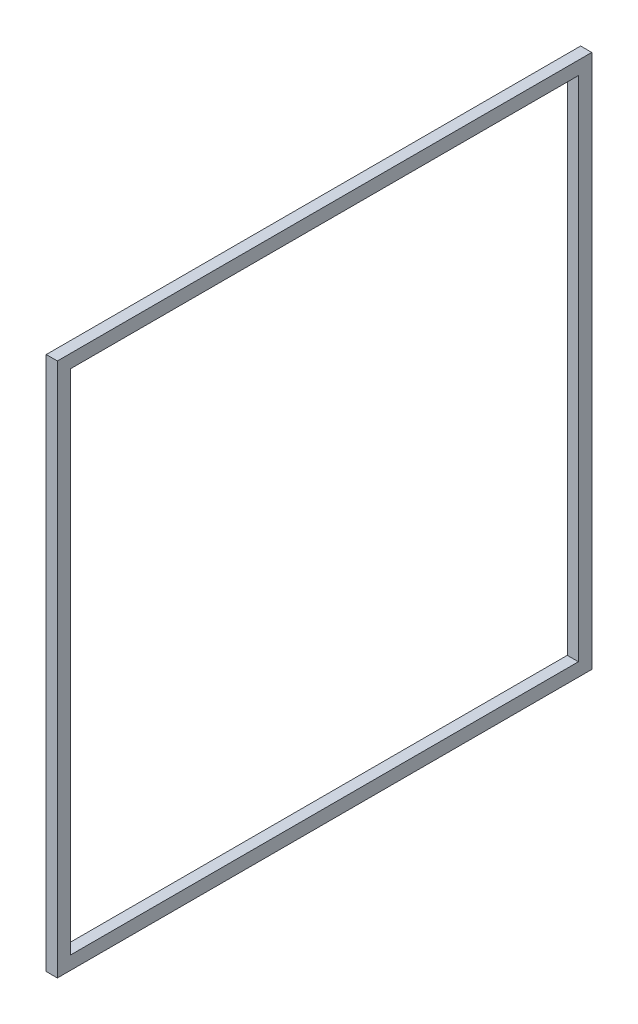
ISO-10303-21;
HEADER;
FILE_DESCRIPTION(('STEP AP214'),'2;1');
FILE_NAME('part.step','',(''),(''),'','','');
FILE_SCHEMA(('AUTOMOTIVE_DESIGN { 1 0 10303 214 1 1 1 1 }'));
ENDSEC;
DATA;
#1=APPLICATION_CONTEXT('core data for automotive mechanical design processes');
#2=APPLICATION_PROTOCOL_DEFINITION('international standard','automotive_design',2000,#1);
#3=PRODUCT_CONTEXT('',#1,'mechanical');
#4=PRODUCT('Part','Part','',(#3));
#5=PRODUCT_RELATED_PRODUCT_CATEGORY('part','',(#4));
#6=PRODUCT_DEFINITION_FORMATION('','',#4);
#7=PRODUCT_DEFINITION_CONTEXT('part definition',#1,'design');
#8=PRODUCT_DEFINITION('design','',#6,#7);
#9=PRODUCT_DEFINITION_SHAPE('','',#8);
#10=(LENGTH_UNIT() NAMED_UNIT(*) SI_UNIT(.MILLI.,.METRE.));
#11=(NAMED_UNIT(*) PLANE_ANGLE_UNIT() SI_UNIT($,.RADIAN.));
#12=(NAMED_UNIT(*) SI_UNIT($,.STERADIAN.) SOLID_ANGLE_UNIT());
#13=UNCERTAINTY_MEASURE_WITH_UNIT(LENGTH_MEASURE(1.E-05),#10,'distance_accuracy_value','');
#14=(GEOMETRIC_REPRESENTATION_CONTEXT(3) GLOBAL_UNCERTAINTY_ASSIGNED_CONTEXT((#13)) GLOBAL_UNIT_ASSIGNED_CONTEXT((#10,
#11,#12)) REPRESENTATION_CONTEXT('',''));
#15=CARTESIAN_POINT('',(0.,0.,0.));
#16=DIRECTION('',(0.,0.,1.));
#17=DIRECTION('',(1.,0.,0.));
#18=AXIS2_PLACEMENT_3D('',#15,#16,#17);
#19=CARTESIAN_POINT('',(6.34999999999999,0.,0.));
#20=DIRECTION('',(1.,0.,0.));
#21=DIRECTION('',(0.,0.,-1.));
#22=AXIS2_PLACEMENT_3D('',#19,#20,#21);
#23=PLANE('',#22);
#24=DIRECTION('',(0.,0.,-1.));
#25=VECTOR('',#24,1.);
#26=CARTESIAN_POINT('',(6.34999999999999,-152.4,152.4));
#27=LINE('',#26,#25);
#28=CARTESIAN_POINT('',(6.34999999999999,-152.4,152.4));
#29=VERTEX_POINT('',#28);
#30=CARTESIAN_POINT('',(6.34999999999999,-152.4,-152.4));
#31=VERTEX_POINT('',#30);
#32=EDGE_CURVE('E156',#29,#31,#27,.T.);
#33=ORIENTED_EDGE('',*,*,#32,.T.);
#34=DIRECTION('',(0.,1.,0.));
#35=VECTOR('',#34,1.);
#36=CARTESIAN_POINT('',(6.34999999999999,-152.4,-152.4));
#37=LINE('',#36,#35);
#38=CARTESIAN_POINT('',(6.34999999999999,152.4,-152.4));
#39=VERTEX_POINT('',#38);
#40=EDGE_CURVE('E164',#31,#39,#37,.T.);
#41=ORIENTED_EDGE('',*,*,#40,.T.);
#42=DIRECTION('',(0.,0.,1.));
#43=VECTOR('',#42,1.);
#44=CARTESIAN_POINT('',(6.34999999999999,152.4,-152.4));
#45=LINE('',#44,#43);
#46=CARTESIAN_POINT('',(6.34999999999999,152.4,152.4));
#47=VERTEX_POINT('',#46);
#48=EDGE_CURVE('E168',#39,#47,#45,.T.);
#49=ORIENTED_EDGE('',*,*,#48,.T.);
#50=DIRECTION('',(0.,-1.,0.));
#51=VECTOR('',#50,1.);
#52=CARTESIAN_POINT('',(6.34999999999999,152.4,152.4));
#53=LINE('',#52,#51);
#54=EDGE_CURVE('E170',#47,#29,#53,.T.);
#55=ORIENTED_EDGE('',*,*,#54,.T.);
#56=EDGE_LOOP('',(#33,#41,#49,#55));
#57=FACE_BOUND('',#56,.T.);
#58=DIRECTION('',(0.,1.,0.));
#59=VECTOR('',#58,1.);
#60=CARTESIAN_POINT('',(6.34999999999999,-144.78,-144.78));
#61=LINE('',#60,#59);
#62=CARTESIAN_POINT('',(6.34999999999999,-144.78,-144.78));
#63=VERTEX_POINT('',#62);
#64=CARTESIAN_POINT('',(6.34999999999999,144.78,-144.78));
#65=VERTEX_POINT('',#64);
#66=EDGE_CURVE('E120',#63,#65,#61,.T.);
#67=ORIENTED_EDGE('',*,*,#66,.F.);
#68=DIRECTION('',(0.,0.,-1.));
#69=VECTOR('',#68,1.);
#70=CARTESIAN_POINT('',(6.34999999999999,-144.78,144.78));
#71=LINE('',#70,#69);
#72=CARTESIAN_POINT('',(6.34999999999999,-144.78,144.78));
#73=VERTEX_POINT('',#72);
#74=EDGE_CURVE('E107',#73,#63,#71,.T.);
#75=ORIENTED_EDGE('',*,*,#74,.F.);
#76=DIRECTION('',(0.,-1.,0.));
#77=VECTOR('',#76,1.);
#78=CARTESIAN_POINT('',(6.34999999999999,144.78,144.78));
#79=LINE('',#78,#77);
#80=CARTESIAN_POINT('',(6.34999999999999,144.78,144.78));
#81=VERTEX_POINT('',#80);
#82=EDGE_CURVE('E136',#81,#73,#79,.T.);
#83=ORIENTED_EDGE('',*,*,#82,.F.);
#84=DIRECTION('',(0.,0.,1.));
#85=VECTOR('',#84,1.);
#86=CARTESIAN_POINT('',(6.34999999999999,144.78,-144.78));
#87=LINE('',#86,#85);
#88=EDGE_CURVE('E131',#65,#81,#87,.T.);
#89=ORIENTED_EDGE('',*,*,#88,.F.);
#90=EDGE_LOOP('',(#67,#75,#83,#89));
#91=FACE_BOUND('',#90,.T.);
#92=ADVANCED_FACE('F43',(#57,#91),#23,.T.);
#93=CARTESIAN_POINT('',(0.,0.,0.));
#94=DIRECTION('',(1.,0.,0.));
#95=DIRECTION('',(0.,0.,-1.));
#96=AXIS2_PLACEMENT_3D('',#93,#94,#95);
#97=PLANE('',#96);
#98=DIRECTION('',(0.,0.,-1.));
#99=VECTOR('',#98,1.);
#100=CARTESIAN_POINT('',(0.,-152.4,152.4));
#101=LINE('',#100,#99);
#102=CARTESIAN_POINT('',(0.,-152.4,152.4));
#103=VERTEX_POINT('',#102);
#104=CARTESIAN_POINT('',(0.,-152.4,-152.4));
#105=VERTEX_POINT('',#104);
#106=EDGE_CURVE('E130',#103,#105,#101,.T.);
#107=ORIENTED_EDGE('',*,*,#106,.F.);
#108=DIRECTION('',(0.,-1.,0.));
#109=VECTOR('',#108,1.);
#110=CARTESIAN_POINT('',(0.,152.4,152.4));
#111=LINE('',#110,#109);
#112=CARTESIAN_POINT('',(0.,152.4,152.4));
#113=VERTEX_POINT('',#112);
#114=EDGE_CURVE('E165',#113,#103,#111,.T.);
#115=ORIENTED_EDGE('',*,*,#114,.F.);
#116=DIRECTION('',(0.,0.,1.));
#117=VECTOR('',#116,1.);
#118=CARTESIAN_POINT('',(0.,152.4,-152.4));
#119=LINE('',#118,#117);
#120=CARTESIAN_POINT('',(0.,152.4,-152.4));
#121=VERTEX_POINT('',#120);
#122=EDGE_CURVE('E177',#121,#113,#119,.T.);
#123=ORIENTED_EDGE('',*,*,#122,.F.);
#124=DIRECTION('',(0.,1.,0.));
#125=VECTOR('',#124,1.);
#126=CARTESIAN_POINT('',(0.,-152.4,-152.4));
#127=LINE('',#126,#125);
#128=EDGE_CURVE('E176',#105,#121,#127,.T.);
#129=ORIENTED_EDGE('',*,*,#128,.F.);
#130=EDGE_LOOP('',(#107,#115,#123,#129));
#131=FACE_BOUND('',#130,.T.);
#132=DIRECTION('',(0.,0.,-1.));
#133=VECTOR('',#132,1.);
#134=CARTESIAN_POINT('',(0.,-144.78,144.78));
#135=LINE('',#134,#133);
#136=CARTESIAN_POINT('',(0.,-144.78,144.78));
#137=VERTEX_POINT('',#136);
#138=CARTESIAN_POINT('',(0.,-144.78,-144.78));
#139=VERTEX_POINT('',#138);
#140=EDGE_CURVE('E70',#137,#139,#135,.T.);
#141=ORIENTED_EDGE('',*,*,#140,.T.);
#142=DIRECTION('',(0.,1.,0.));
#143=VECTOR('',#142,1.);
#144=CARTESIAN_POINT('',(0.,-144.78,-144.78));
#145=LINE('',#144,#143);
#146=CARTESIAN_POINT('',(0.,144.78,-144.78));
#147=VERTEX_POINT('',#146);
#148=EDGE_CURVE('E124',#139,#147,#145,.T.);
#149=ORIENTED_EDGE('',*,*,#148,.T.);
#150=DIRECTION('',(0.,0.,1.));
#151=VECTOR('',#150,1.);
#152=CARTESIAN_POINT('',(0.,144.78,-144.78));
#153=LINE('',#152,#151);
#154=CARTESIAN_POINT('',(0.,144.78,144.78));
#155=VERTEX_POINT('',#154);
#156=EDGE_CURVE('E144',#147,#155,#153,.T.);
#157=ORIENTED_EDGE('',*,*,#156,.T.);
#158=DIRECTION('',(0.,-1.,0.));
#159=VECTOR('',#158,1.);
#160=CARTESIAN_POINT('',(0.,144.78,144.78));
#161=LINE('',#160,#159);
#162=EDGE_CURVE('E116',#155,#137,#161,.T.);
#163=ORIENTED_EDGE('',*,*,#162,.T.);
#164=EDGE_LOOP('',(#141,#149,#157,#163));
#165=FACE_BOUND('',#164,.T.);
#166=ADVANCED_FACE('F201',(#131,#165),#97,.F.);
#167=CARTESIAN_POINT('',(6.34999999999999,-152.4,152.4));
#168=DIRECTION('',(0.,1.,0.));
#169=DIRECTION('',(0.,0.,1.));
#170=AXIS2_PLACEMENT_3D('',#167,#168,#169);
#171=PLANE('',#170);
#172=ORIENTED_EDGE('',*,*,#106,.T.);
#173=DIRECTION('',(-1.,0.,0.));
#174=VECTOR('',#173,1.);
#175=CARTESIAN_POINT('',(6.34999999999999,-152.4,-152.4));
#176=LINE('',#175,#174);
#177=EDGE_CURVE('E11',#31,#105,#176,.T.);
#178=ORIENTED_EDGE('',*,*,#177,.F.);
#179=ORIENTED_EDGE('',*,*,#32,.F.);
#180=DIRECTION('',(-1.,0.,0.));
#181=VECTOR('',#180,1.);
#182=CARTESIAN_POINT('',(6.34999999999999,-152.4,152.4));
#183=LINE('',#182,#181);
#184=EDGE_CURVE('E175',#29,#103,#183,.T.);
#185=ORIENTED_EDGE('',*,*,#184,.T.);
#186=EDGE_LOOP('',(#172,#178,#179,#185));
#187=FACE_BOUND('',#186,.T.);
#188=ADVANCED_FACE('F44',(#187),#171,.F.);
#189=CARTESIAN_POINT('',(6.34999999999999,-152.4,-152.4));
#190=DIRECTION('',(0.,0.,1.));
#191=DIRECTION('',(1.,0.,0.));
#192=AXIS2_PLACEMENT_3D('',#189,#190,#191);
#193=PLANE('',#192);
#194=ORIENTED_EDGE('',*,*,#128,.T.);
#195=DIRECTION('',(-1.,0.,0.));
#196=VECTOR('',#195,1.);
#197=CARTESIAN_POINT('',(6.34999999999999,152.4,-152.4));
#198=LINE('',#197,#196);
#199=EDGE_CURVE('E55',#39,#121,#198,.T.);
#200=ORIENTED_EDGE('',*,*,#199,.F.);
#201=ORIENTED_EDGE('',*,*,#40,.F.);
#202=ORIENTED_EDGE('',*,*,#177,.T.);
#203=EDGE_LOOP('',(#194,#200,#201,#202));
#204=FACE_BOUND('',#203,.T.);
#205=ADVANCED_FACE('F211',(#204),#193,.F.);
#206=CARTESIAN_POINT('',(6.34999999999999,152.4,-152.4));
#207=DIRECTION('',(0.,-1.,0.));
#208=DIRECTION('',(0.,0.,-1.));
#209=AXIS2_PLACEMENT_3D('',#206,#207,#208);
#210=PLANE('',#209);
#211=ORIENTED_EDGE('',*,*,#122,.T.);
#212=DIRECTION('',(-1.,0.,0.));
#213=VECTOR('',#212,1.);
#214=CARTESIAN_POINT('',(6.34999999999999,152.4,152.4));
#215=LINE('',#214,#213);
#216=EDGE_CURVE('E190',#47,#113,#215,.T.);
#217=ORIENTED_EDGE('',*,*,#216,.F.);
#218=ORIENTED_EDGE('',*,*,#48,.F.);
#219=ORIENTED_EDGE('',*,*,#199,.T.);
#220=EDGE_LOOP('',(#211,#217,#218,#219));
#221=FACE_BOUND('',#220,.T.);
#222=ADVANCED_FACE('F200',(#221),#210,.F.);
#223=CARTESIAN_POINT('',(6.34999999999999,152.4,152.4));
#224=DIRECTION('',(0.,0.,-1.));
#225=DIRECTION('',(-1.,0.,0.));
#226=AXIS2_PLACEMENT_3D('',#223,#224,#225);
#227=PLANE('',#226);
#228=ORIENTED_EDGE('',*,*,#114,.T.);
#229=ORIENTED_EDGE('',*,*,#184,.F.);
#230=ORIENTED_EDGE('',*,*,#54,.F.);
#231=ORIENTED_EDGE('',*,*,#216,.T.);
#232=EDGE_LOOP('',(#228,#229,#230,#231));
#233=FACE_BOUND('',#232,.T.);
#234=ADVANCED_FACE('F209',(#233),#227,.F.);
#235=CARTESIAN_POINT('',(6.34999999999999,-144.78,144.78));
#236=DIRECTION('',(0.,1.,0.));
#237=DIRECTION('',(0.,0.,1.));
#238=AXIS2_PLACEMENT_3D('',#235,#236,#237);
#239=PLANE('',#238);
#240=ORIENTED_EDGE('',*,*,#140,.F.);
#241=DIRECTION('',(-1.,0.,0.));
#242=VECTOR('',#241,1.);
#243=CARTESIAN_POINT('',(6.34999999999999,-144.78,144.78));
#244=LINE('',#243,#242);
#245=EDGE_CURVE('E111',#73,#137,#244,.T.);
#246=ORIENTED_EDGE('',*,*,#245,.F.);
#247=ORIENTED_EDGE('',*,*,#74,.T.);
#248=DIRECTION('',(-1.,0.,0.));
#249=VECTOR('',#248,1.);
#250=CARTESIAN_POINT('',(6.34999999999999,-144.78,-144.78));
#251=LINE('',#250,#249);
#252=EDGE_CURVE('E115',#63,#139,#251,.T.);
#253=ORIENTED_EDGE('',*,*,#252,.T.);
#254=EDGE_LOOP('',(#240,#246,#247,#253));
#255=FACE_BOUND('',#254,.T.);
#256=ADVANCED_FACE('F112',(#255),#239,.T.);
#257=CARTESIAN_POINT('',(6.34999999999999,-144.78,-144.78));
#258=DIRECTION('',(0.,0.,1.));
#259=DIRECTION('',(1.,0.,0.));
#260=AXIS2_PLACEMENT_3D('',#257,#258,#259);
#261=PLANE('',#260);
#262=ORIENTED_EDGE('',*,*,#148,.F.);
#263=ORIENTED_EDGE('',*,*,#252,.F.);
#264=ORIENTED_EDGE('',*,*,#66,.T.);
#265=DIRECTION('',(-1.,0.,0.));
#266=VECTOR('',#265,1.);
#267=CARTESIAN_POINT('',(6.34999999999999,144.78,-144.78));
#268=LINE('',#267,#266);
#269=EDGE_CURVE('E126',#65,#147,#268,.T.);
#270=ORIENTED_EDGE('',*,*,#269,.T.);
#271=EDGE_LOOP('',(#262,#263,#264,#270));
#272=FACE_BOUND('',#271,.T.);
#273=ADVANCED_FACE('F122',(#272),#261,.T.);
#274=CARTESIAN_POINT('',(6.34999999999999,144.78,-144.78));
#275=DIRECTION('',(0.,-1.,0.));
#276=DIRECTION('',(0.,0.,-1.));
#277=AXIS2_PLACEMENT_3D('',#274,#275,#276);
#278=PLANE('',#277);
#279=ORIENTED_EDGE('',*,*,#156,.F.);
#280=ORIENTED_EDGE('',*,*,#269,.F.);
#281=ORIENTED_EDGE('',*,*,#88,.T.);
#282=DIRECTION('',(-1.,0.,0.));
#283=VECTOR('',#282,1.);
#284=CARTESIAN_POINT('',(6.34999999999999,144.78,144.78));
#285=LINE('',#284,#283);
#286=EDGE_CURVE('E56',#81,#155,#285,.T.);
#287=ORIENTED_EDGE('',*,*,#286,.T.);
#288=EDGE_LOOP('',(#279,#280,#281,#287));
#289=FACE_BOUND('',#288,.T.);
#290=ADVANCED_FACE('F238',(#289),#278,.T.);
#291=CARTESIAN_POINT('',(6.34999999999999,144.78,144.78));
#292=DIRECTION('',(0.,0.,-1.));
#293=DIRECTION('',(-1.,0.,0.));
#294=AXIS2_PLACEMENT_3D('',#291,#292,#293);
#295=PLANE('',#294);
#296=ORIENTED_EDGE('',*,*,#162,.F.);
#297=ORIENTED_EDGE('',*,*,#286,.F.);
#298=ORIENTED_EDGE('',*,*,#82,.T.);
#299=ORIENTED_EDGE('',*,*,#245,.T.);
#300=EDGE_LOOP('',(#296,#297,#298,#299));
#301=FACE_BOUND('',#300,.T.);
#302=ADVANCED_FACE('F244',(#301),#295,.T.);
#303=CLOSED_SHELL('',(#92,#166,#188,#205,#222,#234,#256,#273,#290,#302));
#304=MANIFOLD_SOLID_BREP('B2',#303);
#305=ADVANCED_BREP_SHAPE_REPRESENTATION('',(#18,#304),#14);
#306=SHAPE_DEFINITION_REPRESENTATION(#9,#305);
ENDSEC;
END-ISO-10303-21;
